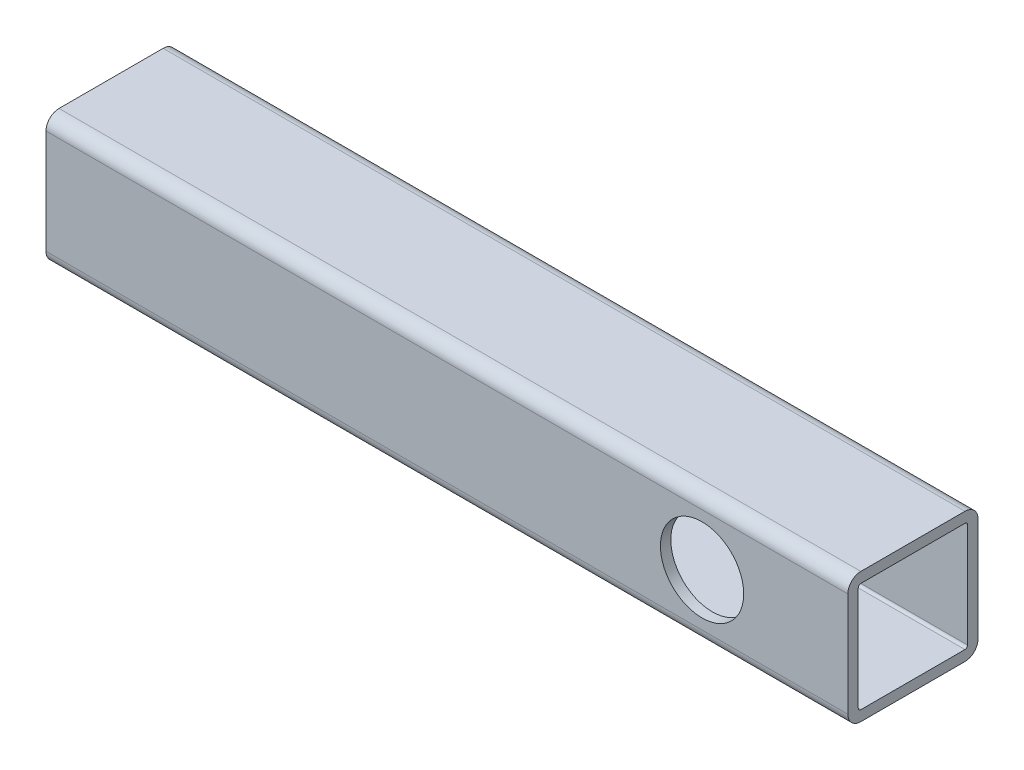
ISO-10303-21;
HEADER;
FILE_DESCRIPTION(('STEP AP214'),'2;1');
FILE_NAME('part.step','',(''),(''),'','','');
FILE_SCHEMA(('AUTOMOTIVE_DESIGN { 1 0 10303 214 1 1 1 1 }'));
ENDSEC;
DATA;
#1=APPLICATION_CONTEXT('core data for automotive mechanical design processes');
#2=APPLICATION_PROTOCOL_DEFINITION('international standard','automotive_design',2000,#1);
#3=PRODUCT_CONTEXT('',#1,'mechanical');
#4=PRODUCT('Part','Part','',(#3));
#5=PRODUCT_RELATED_PRODUCT_CATEGORY('part','',(#4));
#6=PRODUCT_DEFINITION_FORMATION('','',#4);
#7=PRODUCT_DEFINITION_CONTEXT('part definition',#1,'design');
#8=PRODUCT_DEFINITION('design','',#6,#7);
#9=PRODUCT_DEFINITION_SHAPE('','',#8);
#10=(LENGTH_UNIT() NAMED_UNIT(*) SI_UNIT(.MILLI.,.METRE.));
#11=(NAMED_UNIT(*) PLANE_ANGLE_UNIT() SI_UNIT($,.RADIAN.));
#12=(NAMED_UNIT(*) SI_UNIT($,.STERADIAN.) SOLID_ANGLE_UNIT());
#13=UNCERTAINTY_MEASURE_WITH_UNIT(LENGTH_MEASURE(1.E-05),#10,'distance_accuracy_value','');
#14=(GEOMETRIC_REPRESENTATION_CONTEXT(3) GLOBAL_UNCERTAINTY_ASSIGNED_CONTEXT((#13)) GLOBAL_UNIT_ASSIGNED_CONTEXT((#10,
#11,#12)) REPRESENTATION_CONTEXT('',''));
#15=CARTESIAN_POINT('',(0.,0.,0.));
#16=DIRECTION('',(0.,0.,1.));
#17=DIRECTION('',(1.,0.,0.));
#18=AXIS2_PLACEMENT_3D('',#15,#16,#17);
#19=CARTESIAN_POINT('',(154.,-10.,10.));
#20=DIRECTION('',(1.,0.,0.));
#21=DIRECTION('',(0.,0.,-1.));
#22=AXIS2_PLACEMENT_3D('',#19,#20,#21);
#23=PLANE('',#22);
#24=CARTESIAN_POINT('',(154.,-10.,10.));
#25=DIRECTION('',(1.,0.,0.));
#26=DIRECTION('',(0.,0.,-1.));
#27=AXIS2_PLACEMENT_3D('',#24,#25,#26);
#28=CIRCLE('',#27,2.5);
#29=CARTESIAN_POINT('',(154.,-9.99999999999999,12.5));
#30=VERTEX_POINT('',#29);
#31=CARTESIAN_POINT('',(154.,-12.5,9.99999999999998));
#32=VERTEX_POINT('',#31);
#33=EDGE_CURVE('E213',#30,#32,#28,.T.);
#34=ORIENTED_EDGE('',*,*,#33,.T.);
#35=DIRECTION('',(0.,0.,-1.));
#36=VECTOR('',#35,1.);
#37=CARTESIAN_POINT('',(154.,-12.5,9.99999999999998));
#38=LINE('',#37,#36);
#39=CARTESIAN_POINT('',(154.,-12.5,-9.99999999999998));
#40=VERTEX_POINT('',#39);
#41=EDGE_CURVE('E216',#32,#40,#38,.T.);
#42=ORIENTED_EDGE('',*,*,#41,.T.);
#43=CARTESIAN_POINT('',(154.,-10.,-10.));
#44=DIRECTION('',(1.,0.,0.));
#45=DIRECTION('',(0.,0.,-1.));
#46=AXIS2_PLACEMENT_3D('',#43,#44,#45);
#47=CIRCLE('',#46,2.5);
#48=CARTESIAN_POINT('',(154.,-9.99999999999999,-12.5));
#49=VERTEX_POINT('',#48);
#50=EDGE_CURVE('E219',#40,#49,#47,.T.);
#51=ORIENTED_EDGE('',*,*,#50,.T.);
#52=DIRECTION('',(0.,1.,0.));
#53=VECTOR('',#52,1.);
#54=CARTESIAN_POINT('',(154.,9.99999999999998,-12.5));
#55=LINE('',#54,#53);
#56=CARTESIAN_POINT('',(154.,9.99999999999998,-12.5));
#57=VERTEX_POINT('',#56);
#58=EDGE_CURVE('E221',#49,#57,#55,.T.);
#59=ORIENTED_EDGE('',*,*,#58,.T.);
#60=CARTESIAN_POINT('',(154.,10.,-10.));
#61=DIRECTION('',(1.,0.,0.));
#62=DIRECTION('',(0.,0.,1.));
#63=AXIS2_PLACEMENT_3D('',#60,#61,#62);
#64=CIRCLE('',#63,2.5);
#65=CARTESIAN_POINT('',(154.,12.5,-9.99999999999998));
#66=VERTEX_POINT('',#65);
#67=EDGE_CURVE('E223',#57,#66,#64,.T.);
#68=ORIENTED_EDGE('',*,*,#67,.T.);
#69=DIRECTION('',(0.,0.,1.));
#70=VECTOR('',#69,1.);
#71=CARTESIAN_POINT('',(154.,12.5,9.99999999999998));
#72=LINE('',#71,#70);
#73=CARTESIAN_POINT('',(154.,12.5,9.99999999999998));
#74=VERTEX_POINT('',#73);
#75=EDGE_CURVE('E225',#66,#74,#72,.T.);
#76=ORIENTED_EDGE('',*,*,#75,.T.);
#77=CARTESIAN_POINT('',(154.,10.,10.));
#78=DIRECTION('',(1.,0.,0.));
#79=DIRECTION('',(0.,0.,-1.));
#80=AXIS2_PLACEMENT_3D('',#77,#78,#79);
#81=CIRCLE('',#80,2.5);
#82=CARTESIAN_POINT('',(154.,9.99999999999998,12.5));
#83=VERTEX_POINT('',#82);
#84=EDGE_CURVE('E227',#74,#83,#81,.T.);
#85=ORIENTED_EDGE('',*,*,#84,.T.);
#86=DIRECTION('',(0.,-1.,0.));
#87=VECTOR('',#86,1.);
#88=CARTESIAN_POINT('',(154.,9.99999999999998,12.5));
#89=LINE('',#88,#87);
#90=EDGE_CURVE('E229',#83,#30,#89,.T.);
#91=ORIENTED_EDGE('',*,*,#90,.T.);
#92=EDGE_LOOP('',(#34,#42,#51,#59,#68,#76,#85,#91));
#93=FACE_BOUND('',#92,.T.);
#94=DIRECTION('',(0.,-1.,0.));
#95=VECTOR('',#94,1.);
#96=CARTESIAN_POINT('',(154.,9.99999999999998,10.5));
#97=LINE('',#96,#95);
#98=CARTESIAN_POINT('',(154.,9.99999999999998,10.5));
#99=VERTEX_POINT('',#98);
#100=CARTESIAN_POINT('',(154.,-10.,10.5));
#101=VERTEX_POINT('',#100);
#102=EDGE_CURVE('E154',#99,#101,#97,.T.);
#103=ORIENTED_EDGE('',*,*,#102,.F.);
#104=CARTESIAN_POINT('',(154.,10.,10.));
#105=DIRECTION('',(1.,0.,0.));
#106=DIRECTION('',(0.,0.,-1.));
#107=AXIS2_PLACEMENT_3D('',#104,#105,#106);
#108=CIRCLE('',#107,0.5);
#109=CARTESIAN_POINT('',(154.,10.5,9.99999999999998));
#110=VERTEX_POINT('',#109);
#111=EDGE_CURVE('E146',#110,#99,#108,.T.);
#112=ORIENTED_EDGE('',*,*,#111,.F.);
#113=DIRECTION('',(0.,0.,1.));
#114=VECTOR('',#113,1.);
#115=CARTESIAN_POINT('',(154.,10.5,9.99999999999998));
#116=LINE('',#115,#114);
#117=CARTESIAN_POINT('',(154.,10.5,-9.99999999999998));
#118=VERTEX_POINT('',#117);
#119=EDGE_CURVE('E180',#118,#110,#116,.T.);
#120=ORIENTED_EDGE('',*,*,#119,.F.);
#121=CARTESIAN_POINT('',(154.,10.,-10.));
#122=DIRECTION('',(1.,0.,0.));
#123=DIRECTION('',(0.,0.,1.));
#124=AXIS2_PLACEMENT_3D('',#121,#122,#123);
#125=CIRCLE('',#124,0.5);
#126=CARTESIAN_POINT('',(154.,9.99999999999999,-10.5));
#127=VERTEX_POINT('',#126);
#128=EDGE_CURVE('E178',#127,#118,#125,.T.);
#129=ORIENTED_EDGE('',*,*,#128,.F.);
#130=DIRECTION('',(0.,1.,0.));
#131=VECTOR('',#130,1.);
#132=CARTESIAN_POINT('',(154.,9.99999999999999,-10.5));
#133=LINE('',#132,#131);
#134=CARTESIAN_POINT('',(154.,-9.99999999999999,-10.5));
#135=VERTEX_POINT('',#134);
#136=EDGE_CURVE('E176',#135,#127,#133,.T.);
#137=ORIENTED_EDGE('',*,*,#136,.F.);
#138=CARTESIAN_POINT('',(154.,-10.,-10.));
#139=DIRECTION('',(1.,0.,0.));
#140=DIRECTION('',(0.,0.,-1.));
#141=AXIS2_PLACEMENT_3D('',#138,#139,#140);
#142=CIRCLE('',#141,0.499999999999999);
#143=CARTESIAN_POINT('',(154.,-10.5,-10.));
#144=VERTEX_POINT('',#143);
#145=EDGE_CURVE('E174',#144,#135,#142,.T.);
#146=ORIENTED_EDGE('',*,*,#145,.F.);
#147=DIRECTION('',(0.,0.,-1.));
#148=VECTOR('',#147,1.);
#149=CARTESIAN_POINT('',(154.,-10.5,9.99999999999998));
#150=LINE('',#149,#148);
#151=CARTESIAN_POINT('',(154.,-10.5,9.99999999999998));
#152=VERTEX_POINT('',#151);
#153=EDGE_CURVE('E169',#152,#144,#150,.T.);
#154=ORIENTED_EDGE('',*,*,#153,.F.);
#155=CARTESIAN_POINT('',(154.,-10.,10.));
#156=DIRECTION('',(1.,0.,0.));
#157=DIRECTION('',(0.,0.,-1.));
#158=AXIS2_PLACEMENT_3D('',#155,#156,#157);
#159=CIRCLE('',#158,0.5);
#160=EDGE_CURVE('E167',#101,#152,#159,.T.);
#161=ORIENTED_EDGE('',*,*,#160,.F.);
#162=EDGE_LOOP('',(#103,#112,#120,#129,#137,#146,#154,#161));
#163=FACE_BOUND('',#162,.T.);
#164=ADVANCED_FACE('F32',(#93,#163),#23,.T.);
#165=CARTESIAN_POINT('',(0.,-10.,10.));
#166=DIRECTION('',(1.,0.,0.));
#167=DIRECTION('',(0.,0.,-1.));
#168=AXIS2_PLACEMENT_3D('',#165,#166,#167);
#169=PLANE('',#168);
#170=CARTESIAN_POINT('',(0.,-10.,10.));
#171=DIRECTION('',(1.,0.,0.));
#172=DIRECTION('',(0.,0.,-1.));
#173=AXIS2_PLACEMENT_3D('',#170,#171,#172);
#174=CIRCLE('',#173,2.5);
#175=CARTESIAN_POINT('',(0.,-9.99999999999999,12.5));
#176=VERTEX_POINT('',#175);
#177=CARTESIAN_POINT('',(0.,-12.5,9.99999999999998));
#178=VERTEX_POINT('',#177);
#179=EDGE_CURVE('E162',#176,#178,#174,.T.);
#180=ORIENTED_EDGE('',*,*,#179,.F.);
#181=DIRECTION('',(0.,-1.,0.));
#182=VECTOR('',#181,1.);
#183=CARTESIAN_POINT('',(0.,9.99999999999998,12.5));
#184=LINE('',#183,#182);
#185=CARTESIAN_POINT('',(0.,9.99999999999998,12.5));
#186=VERTEX_POINT('',#185);
#187=EDGE_CURVE('E217',#186,#176,#184,.T.);
#188=ORIENTED_EDGE('',*,*,#187,.F.);
#189=CARTESIAN_POINT('',(0.,10.,10.));
#190=DIRECTION('',(1.,0.,0.));
#191=DIRECTION('',(0.,0.,-1.));
#192=AXIS2_PLACEMENT_3D('',#189,#190,#191);
#193=CIRCLE('',#192,2.5);
#194=CARTESIAN_POINT('',(0.,12.5,9.99999999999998));
#195=VERTEX_POINT('',#194);
#196=EDGE_CURVE('E244',#195,#186,#193,.T.);
#197=ORIENTED_EDGE('',*,*,#196,.F.);
#198=DIRECTION('',(0.,0.,1.));
#199=VECTOR('',#198,1.);
#200=CARTESIAN_POINT('',(0.,12.5,9.99999999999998));
#201=LINE('',#200,#199);
#202=CARTESIAN_POINT('',(0.,12.5,-9.99999999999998));
#203=VERTEX_POINT('',#202);
#204=EDGE_CURVE('E242',#203,#195,#201,.T.);
#205=ORIENTED_EDGE('',*,*,#204,.F.);
#206=CARTESIAN_POINT('',(0.,10.,-10.));
#207=DIRECTION('',(1.,0.,0.));
#208=DIRECTION('',(0.,0.,1.));
#209=AXIS2_PLACEMENT_3D('',#206,#207,#208);
#210=CIRCLE('',#209,2.5);
#211=CARTESIAN_POINT('',(0.,9.99999999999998,-12.5));
#212=VERTEX_POINT('',#211);
#213=EDGE_CURVE('E240',#212,#203,#210,.T.);
#214=ORIENTED_EDGE('',*,*,#213,.F.);
#215=DIRECTION('',(0.,1.,0.));
#216=VECTOR('',#215,1.);
#217=CARTESIAN_POINT('',(0.,9.99999999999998,-12.5));
#218=LINE('',#217,#216);
#219=CARTESIAN_POINT('',(0.,-9.99999999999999,-12.5));
#220=VERTEX_POINT('',#219);
#221=EDGE_CURVE('E238',#220,#212,#218,.T.);
#222=ORIENTED_EDGE('',*,*,#221,.F.);
#223=CARTESIAN_POINT('',(0.,-10.,-10.));
#224=DIRECTION('',(1.,0.,0.));
#225=DIRECTION('',(0.,0.,-1.));
#226=AXIS2_PLACEMENT_3D('',#223,#224,#225);
#227=CIRCLE('',#226,2.5);
#228=CARTESIAN_POINT('',(0.,-12.5,-9.99999999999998));
#229=VERTEX_POINT('',#228);
#230=EDGE_CURVE('E236',#229,#220,#227,.T.);
#231=ORIENTED_EDGE('',*,*,#230,.F.);
#232=DIRECTION('',(0.,0.,-1.));
#233=VECTOR('',#232,1.);
#234=CARTESIAN_POINT('',(0.,-12.5,9.99999999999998));
#235=LINE('',#234,#233);
#236=EDGE_CURVE('E234',#178,#229,#235,.T.);
#237=ORIENTED_EDGE('',*,*,#236,.F.);
#238=EDGE_LOOP('',(#180,#188,#197,#205,#214,#222,#231,#237));
#239=FACE_BOUND('',#238,.T.);
#240=CARTESIAN_POINT('',(0.,10.,10.));
#241=DIRECTION('',(1.,0.,0.));
#242=DIRECTION('',(0.,0.,-1.));
#243=AXIS2_PLACEMENT_3D('',#240,#241,#242);
#244=CIRCLE('',#243,0.5);
#245=CARTESIAN_POINT('',(0.,10.5,9.99999999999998));
#246=VERTEX_POINT('',#245);
#247=CARTESIAN_POINT('',(0.,9.99999999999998,10.5));
#248=VERTEX_POINT('',#247);
#249=EDGE_CURVE('E56',#246,#248,#244,.T.);
#250=ORIENTED_EDGE('',*,*,#249,.T.);
#251=DIRECTION('',(0.,-1.,0.));
#252=VECTOR('',#251,1.);
#253=CARTESIAN_POINT('',(0.,9.99999999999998,10.5));
#254=LINE('',#253,#252);
#255=CARTESIAN_POINT('',(0.,-10.,10.5));
#256=VERTEX_POINT('',#255);
#257=EDGE_CURVE('E161',#248,#256,#254,.T.);
#258=ORIENTED_EDGE('',*,*,#257,.T.);
#259=CARTESIAN_POINT('',(0.,-10.,10.));
#260=DIRECTION('',(1.,0.,0.));
#261=DIRECTION('',(0.,0.,-1.));
#262=AXIS2_PLACEMENT_3D('',#259,#260,#261);
#263=CIRCLE('',#262,0.5);
#264=CARTESIAN_POINT('',(0.,-10.5,9.99999999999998));
#265=VERTEX_POINT('',#264);
#266=EDGE_CURVE('E185',#256,#265,#263,.T.);
#267=ORIENTED_EDGE('',*,*,#266,.T.);
#268=DIRECTION('',(0.,0.,-1.));
#269=VECTOR('',#268,1.);
#270=CARTESIAN_POINT('',(0.,-10.5,9.99999999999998));
#271=LINE('',#270,#269);
#272=CARTESIAN_POINT('',(0.,-10.5,-10.));
#273=VERTEX_POINT('',#272);
#274=EDGE_CURVE('E188',#265,#273,#271,.T.);
#275=ORIENTED_EDGE('',*,*,#274,.T.);
#276=CARTESIAN_POINT('',(0.,-10.,-10.));
#277=DIRECTION('',(1.,0.,0.));
#278=DIRECTION('',(0.,0.,-1.));
#279=AXIS2_PLACEMENT_3D('',#276,#277,#278);
#280=CIRCLE('',#279,0.499999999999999);
#281=CARTESIAN_POINT('',(0.,-9.99999999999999,-10.5));
#282=VERTEX_POINT('',#281);
#283=EDGE_CURVE('E191',#273,#282,#280,.T.);
#284=ORIENTED_EDGE('',*,*,#283,.T.);
#285=DIRECTION('',(0.,1.,0.));
#286=VECTOR('',#285,1.);
#287=CARTESIAN_POINT('',(0.,9.99999999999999,-10.5));
#288=LINE('',#287,#286);
#289=CARTESIAN_POINT('',(0.,9.99999999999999,-10.5));
#290=VERTEX_POINT('',#289);
#291=EDGE_CURVE('E194',#282,#290,#288,.T.);
#292=ORIENTED_EDGE('',*,*,#291,.T.);
#293=CARTESIAN_POINT('',(0.,10.,-10.));
#294=DIRECTION('',(1.,0.,0.));
#295=DIRECTION('',(0.,0.,1.));
#296=AXIS2_PLACEMENT_3D('',#293,#294,#295);
#297=CIRCLE('',#296,0.5);
#298=CARTESIAN_POINT('',(0.,10.5,-9.99999999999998));
#299=VERTEX_POINT('',#298);
#300=EDGE_CURVE('E197',#290,#299,#297,.T.);
#301=ORIENTED_EDGE('',*,*,#300,.T.);
#302=DIRECTION('',(0.,0.,1.));
#303=VECTOR('',#302,1.);
#304=CARTESIAN_POINT('',(0.,10.5,9.99999999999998));
#305=LINE('',#304,#303);
#306=EDGE_CURVE('E155',#299,#246,#305,.T.);
#307=ORIENTED_EDGE('',*,*,#306,.T.);
#308=EDGE_LOOP('',(#250,#258,#267,#275,#284,#292,#301,#307));
#309=FACE_BOUND('',#308,.T.);
#310=ADVANCED_FACE('F275',(#239,#309),#169,.F.);
#311=CARTESIAN_POINT('',(154.,-10.,10.));
#312=DIRECTION('',(-1.,0.,0.));
#313=DIRECTION('',(0.,0.,1.));
#314=AXIS2_PLACEMENT_3D('',#311,#312,#313);
#315=CYLINDRICAL_SURFACE('',#314,2.5);
#316=ORIENTED_EDGE('',*,*,#179,.T.);
#317=DIRECTION('',(-1.,0.,0.));
#318=VECTOR('',#317,1.);
#319=CARTESIAN_POINT('',(154.,-12.5,9.99999999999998));
#320=LINE('',#319,#318);
#321=EDGE_CURVE('E11',#32,#178,#320,.T.);
#322=ORIENTED_EDGE('',*,*,#321,.F.);
#323=ORIENTED_EDGE('',*,*,#33,.F.);
#324=DIRECTION('',(-1.,0.,0.));
#325=VECTOR('',#324,1.);
#326=CARTESIAN_POINT('',(154.,-9.99999999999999,12.5));
#327=LINE('',#326,#325);
#328=EDGE_CURVE('E231',#30,#176,#327,.T.);
#329=ORIENTED_EDGE('',*,*,#328,.T.);
#330=EDGE_LOOP('',(#316,#322,#323,#329));
#331=FACE_BOUND('',#330,.T.);
#332=ADVANCED_FACE('F34',(#331),#315,.T.);
#333=CARTESIAN_POINT('',(154.,-12.5,9.99999999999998));
#334=DIRECTION('',(0.,1.,0.));
#335=DIRECTION('',(0.,0.,1.));
#336=AXIS2_PLACEMENT_3D('',#333,#334,#335);
#337=PLANE('',#336);
#338=ORIENTED_EDGE('',*,*,#236,.T.);
#339=DIRECTION('',(-1.,0.,0.));
#340=VECTOR('',#339,1.);
#341=CARTESIAN_POINT('',(154.,-12.5,-9.99999999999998));
#342=LINE('',#341,#340);
#343=EDGE_CURVE('E41',#40,#229,#342,.T.);
#344=ORIENTED_EDGE('',*,*,#343,.F.);
#345=ORIENTED_EDGE('',*,*,#41,.F.);
#346=ORIENTED_EDGE('',*,*,#321,.T.);
#347=EDGE_LOOP('',(#338,#344,#345,#346));
#348=FACE_BOUND('',#347,.T.);
#349=ADVANCED_FACE('F292',(#348),#337,.F.);
#350=CARTESIAN_POINT('',(154.,-10.,-10.));
#351=DIRECTION('',(-1.,0.,0.));
#352=DIRECTION('',(0.,0.,1.));
#353=AXIS2_PLACEMENT_3D('',#350,#351,#352);
#354=CYLINDRICAL_SURFACE('',#353,2.5);
#355=ORIENTED_EDGE('',*,*,#230,.T.);
#356=DIRECTION('',(-1.,0.,0.));
#357=VECTOR('',#356,1.);
#358=CARTESIAN_POINT('',(154.,-9.99999999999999,-12.5));
#359=LINE('',#358,#357);
#360=EDGE_CURVE('E261',#49,#220,#359,.T.);
#361=ORIENTED_EDGE('',*,*,#360,.F.);
#362=ORIENTED_EDGE('',*,*,#50,.F.);
#363=ORIENTED_EDGE('',*,*,#343,.T.);
#364=EDGE_LOOP('',(#355,#361,#362,#363));
#365=FACE_BOUND('',#364,.T.);
#366=ADVANCED_FACE('F269',(#365),#354,.T.);
#367=CARTESIAN_POINT('',(154.,9.99999999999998,-12.5));
#368=DIRECTION('',(0.,0.,1.));
#369=DIRECTION('',(0.,-1.,0.));
#370=AXIS2_PLACEMENT_3D('',#367,#368,#369);
#371=PLANE('',#370);
#372=CARTESIAN_POINT('',(126.,0.,-12.5));
#373=DIRECTION('',(0.,0.,1.));
#374=DIRECTION('',(1.,0.,0.));
#375=AXIS2_PLACEMENT_3D('',#372,#373,#374);
#376=CIRCLE('',#375,8.00000000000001);
#377=CARTESIAN_POINT('',(134.,0.,-12.5));
#378=VERTEX_POINT('',#377);
#379=EDGE_CURVE('E332',#378,#378,#376,.T.);
#380=ORIENTED_EDGE('',*,*,#379,.T.);
#381=EDGE_LOOP('',(#380));
#382=FACE_BOUND('',#381,.T.);
#383=ORIENTED_EDGE('',*,*,#221,.T.);
#384=DIRECTION('',(-1.,0.,0.));
#385=VECTOR('',#384,1.);
#386=CARTESIAN_POINT('',(154.,9.99999999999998,-12.5));
#387=LINE('',#386,#385);
#388=EDGE_CURVE('E258',#57,#212,#387,.T.);
#389=ORIENTED_EDGE('',*,*,#388,.F.);
#390=ORIENTED_EDGE('',*,*,#58,.F.);
#391=ORIENTED_EDGE('',*,*,#360,.T.);
#392=EDGE_LOOP('',(#383,#389,#390,#391));
#393=FACE_BOUND('',#392,.T.);
#394=ADVANCED_FACE('F281',(#382,#393),#371,.F.);
#395=CARTESIAN_POINT('',(154.,10.,-10.));
#396=DIRECTION('',(-1.,0.,0.));
#397=DIRECTION('',(0.,0.,1.));
#398=AXIS2_PLACEMENT_3D('',#395,#396,#397);
#399=CYLINDRICAL_SURFACE('',#398,2.5);
#400=ORIENTED_EDGE('',*,*,#213,.T.);
#401=DIRECTION('',(-1.,0.,0.));
#402=VECTOR('',#401,1.);
#403=CARTESIAN_POINT('',(154.,12.5,-9.99999999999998));
#404=LINE('',#403,#402);
#405=EDGE_CURVE('E255',#66,#203,#404,.T.);
#406=ORIENTED_EDGE('',*,*,#405,.F.);
#407=ORIENTED_EDGE('',*,*,#67,.F.);
#408=ORIENTED_EDGE('',*,*,#388,.T.);
#409=EDGE_LOOP('',(#400,#406,#407,#408));
#410=FACE_BOUND('',#409,.T.);
#411=ADVANCED_FACE('F285',(#410),#399,.T.);
#412=CARTESIAN_POINT('',(154.,12.5,9.99999999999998));
#413=DIRECTION('',(0.,-1.,0.));
#414=DIRECTION('',(0.,0.,-1.));
#415=AXIS2_PLACEMENT_3D('',#412,#413,#414);
#416=PLANE('',#415);
#417=ORIENTED_EDGE('',*,*,#204,.T.);
#418=DIRECTION('',(-1.,0.,0.));
#419=VECTOR('',#418,1.);
#420=CARTESIAN_POINT('',(154.,12.5,9.99999999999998));
#421=LINE('',#420,#419);
#422=EDGE_CURVE('E252',#74,#195,#421,.T.);
#423=ORIENTED_EDGE('',*,*,#422,.F.);
#424=ORIENTED_EDGE('',*,*,#75,.F.);
#425=ORIENTED_EDGE('',*,*,#405,.T.);
#426=EDGE_LOOP('',(#417,#423,#424,#425));
#427=FACE_BOUND('',#426,.T.);
#428=ADVANCED_FACE('F305',(#427),#416,.F.);
#429=CARTESIAN_POINT('',(154.,10.,10.));
#430=DIRECTION('',(-1.,0.,0.));
#431=DIRECTION('',(0.,0.,1.));
#432=AXIS2_PLACEMENT_3D('',#429,#430,#431);
#433=CYLINDRICAL_SURFACE('',#432,2.5);
#434=ORIENTED_EDGE('',*,*,#196,.T.);
#435=DIRECTION('',(-1.,0.,0.));
#436=VECTOR('',#435,1.);
#437=CARTESIAN_POINT('',(154.,9.99999999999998,12.5));
#438=LINE('',#437,#436);
#439=EDGE_CURVE('E249',#83,#186,#438,.T.);
#440=ORIENTED_EDGE('',*,*,#439,.F.);
#441=ORIENTED_EDGE('',*,*,#84,.F.);
#442=ORIENTED_EDGE('',*,*,#422,.T.);
#443=EDGE_LOOP('',(#434,#440,#441,#442));
#444=FACE_BOUND('',#443,.T.);
#445=ADVANCED_FACE('F303',(#444),#433,.T.);
#446=CARTESIAN_POINT('',(154.,9.99999999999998,12.5));
#447=DIRECTION('',(0.,0.,-1.));
#448=DIRECTION('',(0.,1.,0.));
#449=AXIS2_PLACEMENT_3D('',#446,#447,#448);
#450=PLANE('',#449);
#451=CARTESIAN_POINT('',(126.,0.,12.5));
#452=DIRECTION('',(0.,0.,1.));
#453=DIRECTION('',(1.,0.,0.));
#454=AXIS2_PLACEMENT_3D('',#451,#452,#453);
#455=CIRCLE('',#454,8.00000000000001);
#456=CARTESIAN_POINT('',(134.,0.,12.5));
#457=VERTEX_POINT('',#456);
#458=EDGE_CURVE('E330',#457,#457,#455,.T.);
#459=ORIENTED_EDGE('',*,*,#458,.F.);
#460=EDGE_LOOP('',(#459));
#461=FACE_BOUND('',#460,.T.);
#462=ORIENTED_EDGE('',*,*,#187,.T.);
#463=ORIENTED_EDGE('',*,*,#328,.F.);
#464=ORIENTED_EDGE('',*,*,#90,.F.);
#465=ORIENTED_EDGE('',*,*,#439,.T.);
#466=EDGE_LOOP('',(#462,#463,#464,#465));
#467=FACE_BOUND('',#466,.T.);
#468=ADVANCED_FACE('F298',(#461,#467),#450,.F.);
#469=CARTESIAN_POINT('',(154.,10.,10.));
#470=DIRECTION('',(-1.,0.,0.));
#471=DIRECTION('',(0.,0.,1.));
#472=AXIS2_PLACEMENT_3D('',#469,#470,#471);
#473=CYLINDRICAL_SURFACE('',#472,0.5);
#474=ORIENTED_EDGE('',*,*,#249,.F.);
#475=DIRECTION('',(-1.,0.,0.));
#476=VECTOR('',#475,1.);
#477=CARTESIAN_POINT('',(154.,10.5,9.99999999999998));
#478=LINE('',#477,#476);
#479=EDGE_CURVE('E150',#110,#246,#478,.T.);
#480=ORIENTED_EDGE('',*,*,#479,.F.);
#481=ORIENTED_EDGE('',*,*,#111,.T.);
#482=DIRECTION('',(-1.,0.,0.));
#483=VECTOR('',#482,1.);
#484=CARTESIAN_POINT('',(154.,9.99999999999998,10.5));
#485=LINE('',#484,#483);
#486=EDGE_CURVE('E149',#99,#248,#485,.T.);
#487=ORIENTED_EDGE('',*,*,#486,.T.);
#488=EDGE_LOOP('',(#474,#480,#481,#487));
#489=FACE_BOUND('',#488,.T.);
#490=ADVANCED_FACE('F148',(#489),#473,.F.);
#491=CARTESIAN_POINT('',(154.,9.99999999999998,10.5));
#492=DIRECTION('',(0.,0.,-1.));
#493=DIRECTION('',(0.,1.,0.));
#494=AXIS2_PLACEMENT_3D('',#491,#492,#493);
#495=PLANE('',#494);
#496=CARTESIAN_POINT('',(126.,0.,10.5));
#497=DIRECTION('',(0.,0.,-1.));
#498=DIRECTION('',(0.,1.,0.));
#499=AXIS2_PLACEMENT_3D('',#496,#497,#498);
#500=CIRCLE('',#499,8.00000000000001);
#501=CARTESIAN_POINT('',(126.,8.00000000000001,10.5));
#502=VERTEX_POINT('',#501);
#503=EDGE_CURVE('E183',#502,#502,#500,.T.);
#504=ORIENTED_EDGE('',*,*,#503,.F.);
#505=EDGE_LOOP('',(#504));
#506=FACE_BOUND('',#505,.T.);
#507=ORIENTED_EDGE('',*,*,#257,.F.);
#508=ORIENTED_EDGE('',*,*,#486,.F.);
#509=ORIENTED_EDGE('',*,*,#102,.T.);
#510=DIRECTION('',(-1.,0.,0.));
#511=VECTOR('',#510,1.);
#512=CARTESIAN_POINT('',(154.,-10.,10.5));
#513=LINE('',#512,#511);
#514=EDGE_CURVE('E163',#101,#256,#513,.T.);
#515=ORIENTED_EDGE('',*,*,#514,.T.);
#516=EDGE_LOOP('',(#507,#508,#509,#515));
#517=FACE_BOUND('',#516,.T.);
#518=ADVANCED_FACE('F158',(#506,#517),#495,.T.);
#519=CARTESIAN_POINT('',(154.,-10.,10.));
#520=DIRECTION('',(-1.,0.,0.));
#521=DIRECTION('',(0.,0.,1.));
#522=AXIS2_PLACEMENT_3D('',#519,#520,#521);
#523=CYLINDRICAL_SURFACE('',#522,0.5);
#524=ORIENTED_EDGE('',*,*,#266,.F.);
#525=ORIENTED_EDGE('',*,*,#514,.F.);
#526=ORIENTED_EDGE('',*,*,#160,.T.);
#527=DIRECTION('',(-1.,0.,0.));
#528=VECTOR('',#527,1.);
#529=CARTESIAN_POINT('',(154.,-10.5,9.99999999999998));
#530=LINE('',#529,#528);
#531=EDGE_CURVE('E210',#152,#265,#530,.T.);
#532=ORIENTED_EDGE('',*,*,#531,.T.);
#533=EDGE_LOOP('',(#524,#525,#526,#532));
#534=FACE_BOUND('',#533,.T.);
#535=ADVANCED_FACE('F379',(#534),#523,.F.);
#536=CARTESIAN_POINT('',(154.,-10.5,9.99999999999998));
#537=DIRECTION('',(0.,1.,0.));
#538=DIRECTION('',(0.,0.,1.));
#539=AXIS2_PLACEMENT_3D('',#536,#537,#538);
#540=PLANE('',#539);
#541=ORIENTED_EDGE('',*,*,#274,.F.);
#542=ORIENTED_EDGE('',*,*,#531,.F.);
#543=ORIENTED_EDGE('',*,*,#153,.T.);
#544=DIRECTION('',(-1.,0.,0.));
#545=VECTOR('',#544,1.);
#546=CARTESIAN_POINT('',(154.,-10.5,-10.));
#547=LINE('',#546,#545);
#548=EDGE_CURVE('E208',#144,#273,#547,.T.);
#549=ORIENTED_EDGE('',*,*,#548,.T.);
#550=EDGE_LOOP('',(#541,#542,#543,#549));
#551=FACE_BOUND('',#550,.T.);
#552=ADVANCED_FACE('F376',(#551),#540,.T.);
#553=CARTESIAN_POINT('',(154.,-10.,-10.));
#554=DIRECTION('',(-1.,0.,0.));
#555=DIRECTION('',(0.,0.,1.));
#556=AXIS2_PLACEMENT_3D('',#553,#554,#555);
#557=CYLINDRICAL_SURFACE('',#556,0.499999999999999);
#558=ORIENTED_EDGE('',*,*,#283,.F.);
#559=ORIENTED_EDGE('',*,*,#548,.F.);
#560=ORIENTED_EDGE('',*,*,#145,.T.);
#561=DIRECTION('',(-1.,0.,0.));
#562=VECTOR('',#561,1.);
#563=CARTESIAN_POINT('',(154.,-9.99999999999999,-10.5));
#564=LINE('',#563,#562);
#565=EDGE_CURVE('E206',#135,#282,#564,.T.);
#566=ORIENTED_EDGE('',*,*,#565,.T.);
#567=EDGE_LOOP('',(#558,#559,#560,#566));
#568=FACE_BOUND('',#567,.T.);
#569=ADVANCED_FACE('F349',(#568),#557,.F.);
#570=CARTESIAN_POINT('',(154.,9.99999999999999,-10.5));
#571=DIRECTION('',(0.,0.,1.));
#572=DIRECTION('',(0.,-1.,0.));
#573=AXIS2_PLACEMENT_3D('',#570,#571,#572);
#574=PLANE('',#573);
#575=CARTESIAN_POINT('',(126.,0.,-10.5));
#576=DIRECTION('',(0.,0.,1.));
#577=DIRECTION('',(0.,-1.,0.));
#578=AXIS2_PLACEMENT_3D('',#575,#576,#577);
#579=CIRCLE('',#578,8.00000000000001);
#580=CARTESIAN_POINT('',(126.,-8.00000000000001,-10.5));
#581=VERTEX_POINT('',#580);
#582=EDGE_CURVE('E36',#581,#581,#579,.T.);
#583=ORIENTED_EDGE('',*,*,#582,.F.);
#584=EDGE_LOOP('',(#583));
#585=FACE_BOUND('',#584,.T.);
#586=ORIENTED_EDGE('',*,*,#291,.F.);
#587=ORIENTED_EDGE('',*,*,#565,.F.);
#588=ORIENTED_EDGE('',*,*,#136,.T.);
#589=DIRECTION('',(-1.,0.,0.));
#590=VECTOR('',#589,1.);
#591=CARTESIAN_POINT('',(154.,9.99999999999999,-10.5));
#592=LINE('',#591,#590);
#593=EDGE_CURVE('E204',#127,#290,#592,.T.);
#594=ORIENTED_EDGE('',*,*,#593,.T.);
#595=EDGE_LOOP('',(#586,#587,#588,#594));
#596=FACE_BOUND('',#595,.T.);
#597=ADVANCED_FACE('F345',(#585,#596),#574,.T.);
#598=CARTESIAN_POINT('',(154.,10.,-10.));
#599=DIRECTION('',(-1.,0.,0.));
#600=DIRECTION('',(0.,0.,1.));
#601=AXIS2_PLACEMENT_3D('',#598,#599,#600);
#602=CYLINDRICAL_SURFACE('',#601,0.5);
#603=ORIENTED_EDGE('',*,*,#300,.F.);
#604=ORIENTED_EDGE('',*,*,#593,.F.);
#605=ORIENTED_EDGE('',*,*,#128,.T.);
#606=DIRECTION('',(-1.,0.,0.));
#607=VECTOR('',#606,1.);
#608=CARTESIAN_POINT('',(154.,10.5,-9.99999999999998));
#609=LINE('',#608,#607);
#610=EDGE_CURVE('E48',#118,#299,#609,.T.);
#611=ORIENTED_EDGE('',*,*,#610,.T.);
#612=EDGE_LOOP('',(#603,#604,#605,#611));
#613=FACE_BOUND('',#612,.T.);
#614=ADVANCED_FACE('F348',(#613),#602,.F.);
#615=CARTESIAN_POINT('',(154.,10.5,9.99999999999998));
#616=DIRECTION('',(0.,-1.,0.));
#617=DIRECTION('',(0.,0.,-1.));
#618=AXIS2_PLACEMENT_3D('',#615,#616,#617);
#619=PLANE('',#618);
#620=ORIENTED_EDGE('',*,*,#306,.F.);
#621=ORIENTED_EDGE('',*,*,#610,.F.);
#622=ORIENTED_EDGE('',*,*,#119,.T.);
#623=ORIENTED_EDGE('',*,*,#479,.T.);
#624=EDGE_LOOP('',(#620,#621,#622,#623));
#625=FACE_BOUND('',#624,.T.);
#626=ADVANCED_FACE('F363',(#625),#619,.T.);
#627=CARTESIAN_POINT('',(126.,0.,-12.5));
#628=DIRECTION('',(0.,0.,1.));
#629=DIRECTION('',(1.,0.,0.));
#630=AXIS2_PLACEMENT_3D('',#627,#628,#629);
#631=CYLINDRICAL_SURFACE('',#630,8.00000000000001);
#632=ORIENTED_EDGE('',*,*,#582,.T.);
#633=EDGE_LOOP('',(#632));
#634=FACE_BOUND('',#633,.T.);
#635=ORIENTED_EDGE('',*,*,#379,.F.);
#636=EDGE_LOOP('',(#635));
#637=FACE_BOUND('',#636,.T.);
#638=ADVANCED_FACE('F342',(#634,#637),#631,.F.);
#639=ORIENTED_EDGE('',*,*,#503,.T.);
#640=EDGE_LOOP('',(#639));
#641=FACE_BOUND('',#640,.T.);
#642=ORIENTED_EDGE('',*,*,#458,.T.);
#643=EDGE_LOOP('',(#642));
#644=FACE_BOUND('',#643,.T.);
#645=ADVANCED_FACE('F370',(#641,#644),#631,.F.);
#646=CLOSED_SHELL('',(#164,#310,#332,#349,#366,#394,#411,#428,#445,#468,#490,#518,#535,#552,
#569,#597,#614,#626,#638,#645));
#647=MANIFOLD_SOLID_BREP('B2',#646);
#648=ADVANCED_BREP_SHAPE_REPRESENTATION('',(#18,#647),#14);
#649=SHAPE_DEFINITION_REPRESENTATION(#9,#648);
ENDSEC;
END-ISO-10303-21;
